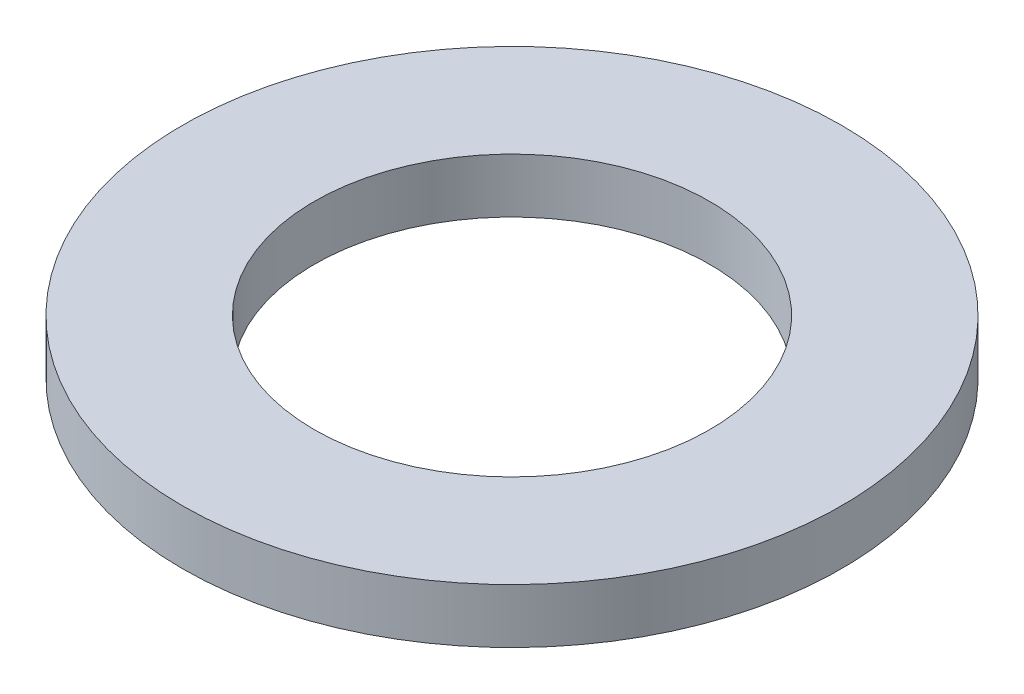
from build123d import *

# Parameters (mm, degrees)
SKETCH1_R      = 72.5
SKETCH1_R_2    = 43.5
EXTRUDE1_DEPTH = 12


with BuildPart() as part:
    # Sketch1 → Extrude1 (new body)
    with BuildSketch(Plane(origin=(0, 0, 0), x_dir=(1, 0, 0), z_dir=(0, 1, 0))):
        with Locations(Location((0, 0, 0), (0, 0, 270))):
            Circle(SKETCH1_R)
        with Locations(Location((0, 0, 0), (0, 0, 270))):
            Circle(SKETCH1_R_2, mode=Mode.SUBTRACT)
    extrude(amount=EXTRUDE1_DEPTH)


solid = part.part
